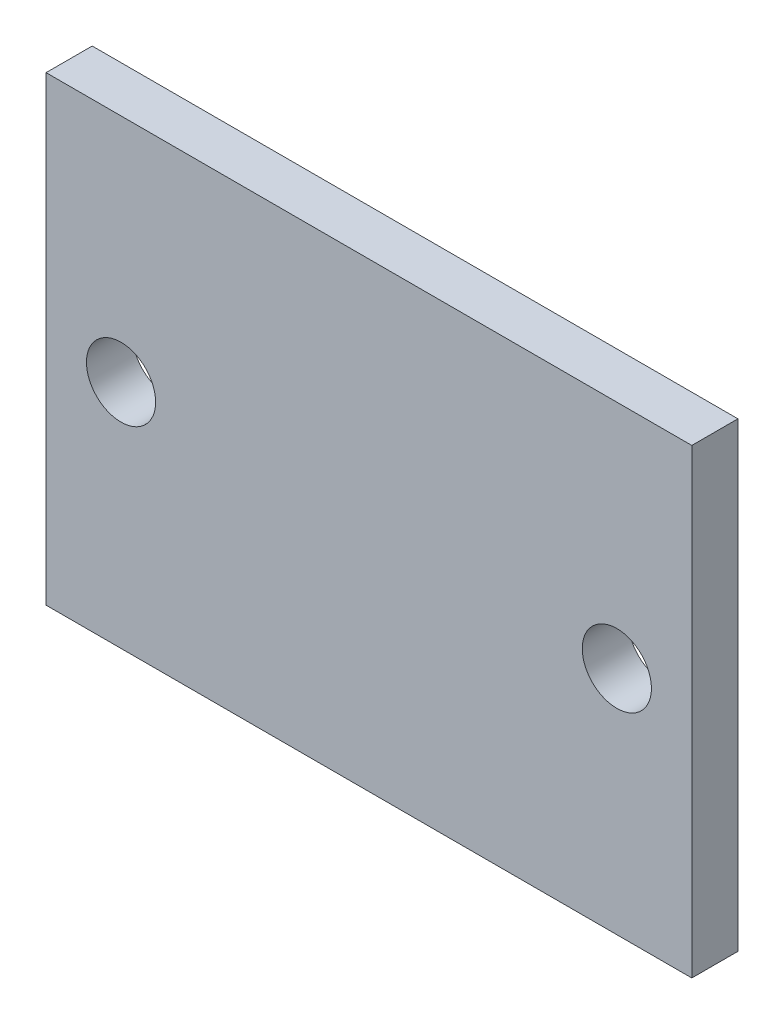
ISO-10303-21;
HEADER;
FILE_DESCRIPTION(('STEP AP214'),'2;1');
FILE_NAME('part.step','',(''),(''),'','','');
FILE_SCHEMA(('AUTOMOTIVE_DESIGN { 1 0 10303 214 1 1 1 1 }'));
ENDSEC;
DATA;
#1=APPLICATION_CONTEXT('core data for automotive mechanical design processes');
#2=APPLICATION_PROTOCOL_DEFINITION('international standard','automotive_design',2000,#1);
#3=PRODUCT_CONTEXT('',#1,'mechanical');
#4=PRODUCT('Part','Part','',(#3));
#5=PRODUCT_RELATED_PRODUCT_CATEGORY('part','',(#4));
#6=PRODUCT_DEFINITION_FORMATION('','',#4);
#7=PRODUCT_DEFINITION_CONTEXT('part definition',#1,'design');
#8=PRODUCT_DEFINITION('design','',#6,#7);
#9=PRODUCT_DEFINITION_SHAPE('','',#8);
#10=(LENGTH_UNIT() NAMED_UNIT(*) SI_UNIT(.MILLI.,.METRE.));
#11=(NAMED_UNIT(*) PLANE_ANGLE_UNIT() SI_UNIT($,.RADIAN.));
#12=(NAMED_UNIT(*) SI_UNIT($,.STERADIAN.) SOLID_ANGLE_UNIT());
#13=UNCERTAINTY_MEASURE_WITH_UNIT(LENGTH_MEASURE(1.E-05),#10,'distance_accuracy_value','');
#14=(GEOMETRIC_REPRESENTATION_CONTEXT(3) GLOBAL_UNCERTAINTY_ASSIGNED_CONTEXT((#13)) GLOBAL_UNIT_ASSIGNED_CONTEXT((#10,
#11,#12)) REPRESENTATION_CONTEXT('',''));
#15=CARTESIAN_POINT('',(0.,0.,0.));
#16=DIRECTION('',(0.,0.,1.));
#17=DIRECTION('',(1.,0.,0.));
#18=AXIS2_PLACEMENT_3D('',#15,#16,#17);
#19=CARTESIAN_POINT('',(-14.,-10.,2.));
#20=DIRECTION('',(1.,0.,0.));
#21=DIRECTION('',(0.,0.,-1.));
#22=AXIS2_PLACEMENT_3D('',#19,#20,#21);
#23=PLANE('',#22);
#24=DIRECTION('',(0.,-1.,0.));
#25=VECTOR('',#24,1.);
#26=CARTESIAN_POINT('',(-14.,-10.,0.));
#27=LINE('',#26,#25);
#28=CARTESIAN_POINT('',(-14.,10.,0.));
#29=VERTEX_POINT('',#28);
#30=CARTESIAN_POINT('',(-14.,-10.,0.));
#31=VERTEX_POINT('',#30);
#32=EDGE_CURVE('E99',#29,#31,#27,.T.);
#33=ORIENTED_EDGE('',*,*,#32,.T.);
#34=DIRECTION('',(0.,0.,-1.));
#35=VECTOR('',#34,1.);
#36=CARTESIAN_POINT('',(-14.,-10.,2.));
#37=LINE('',#36,#35);
#38=CARTESIAN_POINT('',(-14.,-10.,2.));
#39=VERTEX_POINT('',#38);
#40=EDGE_CURVE('E11',#39,#31,#37,.T.);
#41=ORIENTED_EDGE('',*,*,#40,.F.);
#42=DIRECTION('',(0.,-1.,0.));
#43=VECTOR('',#42,1.);
#44=CARTESIAN_POINT('',(-14.,-10.,2.));
#45=LINE('',#44,#43);
#46=CARTESIAN_POINT('',(-14.,10.,2.));
#47=VERTEX_POINT('',#46);
#48=EDGE_CURVE('E87',#47,#39,#45,.T.);
#49=ORIENTED_EDGE('',*,*,#48,.F.);
#50=DIRECTION('',(0.,0.,-1.));
#51=VECTOR('',#50,1.);
#52=CARTESIAN_POINT('',(-14.,10.,2.));
#53=LINE('',#52,#51);
#54=EDGE_CURVE('E95',#47,#29,#53,.T.);
#55=ORIENTED_EDGE('',*,*,#54,.T.);
#56=EDGE_LOOP('',(#33,#41,#49,#55));
#57=FACE_BOUND('',#56,.T.);
#58=ADVANCED_FACE('F36',(#57),#23,.F.);
#59=CARTESIAN_POINT('',(14.,-10.,2.));
#60=DIRECTION('',(0.,1.,0.));
#61=DIRECTION('',(-1.,0.,0.));
#62=AXIS2_PLACEMENT_3D('',#59,#60,#61);
#63=PLANE('',#62);
#64=DIRECTION('',(1.,0.,0.));
#65=VECTOR('',#64,1.);
#66=CARTESIAN_POINT('',(14.,-10.,0.));
#67=LINE('',#66,#65);
#68=CARTESIAN_POINT('',(14.,-10.,0.));
#69=VERTEX_POINT('',#68);
#70=EDGE_CURVE('E91',#31,#69,#67,.T.);
#71=ORIENTED_EDGE('',*,*,#70,.T.);
#72=DIRECTION('',(0.,0.,-1.));
#73=VECTOR('',#72,1.);
#74=CARTESIAN_POINT('',(14.,-10.,2.));
#75=LINE('',#74,#73);
#76=CARTESIAN_POINT('',(14.,-10.,2.));
#77=VERTEX_POINT('',#76);
#78=EDGE_CURVE('E44',#77,#69,#75,.T.);
#79=ORIENTED_EDGE('',*,*,#78,.F.);
#80=DIRECTION('',(1.,0.,0.));
#81=VECTOR('',#80,1.);
#82=CARTESIAN_POINT('',(14.,-10.,2.));
#83=LINE('',#82,#81);
#84=EDGE_CURVE('E82',#39,#77,#83,.T.);
#85=ORIENTED_EDGE('',*,*,#84,.F.);
#86=ORIENTED_EDGE('',*,*,#40,.T.);
#87=EDGE_LOOP('',(#71,#79,#85,#86));
#88=FACE_BOUND('',#87,.T.);
#89=ADVANCED_FACE('F90',(#88),#63,.F.);
#90=CARTESIAN_POINT('',(14.,-10.,2.));
#91=DIRECTION('',(-1.,0.,0.));
#92=DIRECTION('',(0.,-1.,0.));
#93=AXIS2_PLACEMENT_3D('',#90,#91,#92);
#94=PLANE('',#93);
#95=DIRECTION('',(0.,1.,0.));
#96=VECTOR('',#95,1.);
#97=CARTESIAN_POINT('',(14.,-10.,0.));
#98=LINE('',#97,#96);
#99=CARTESIAN_POINT('',(14.,10.,0.));
#100=VERTEX_POINT('',#99);
#101=EDGE_CURVE('E69',#69,#100,#98,.T.);
#102=ORIENTED_EDGE('',*,*,#101,.T.);
#103=DIRECTION('',(0.,0.,-1.));
#104=VECTOR('',#103,1.);
#105=CARTESIAN_POINT('',(14.,10.,2.));
#106=LINE('',#105,#104);
#107=CARTESIAN_POINT('',(14.,10.,2.));
#108=VERTEX_POINT('',#107);
#109=EDGE_CURVE('E92',#108,#100,#106,.T.);
#110=ORIENTED_EDGE('',*,*,#109,.F.);
#111=DIRECTION('',(0.,1.,0.));
#112=VECTOR('',#111,1.);
#113=CARTESIAN_POINT('',(14.,-10.,2.));
#114=LINE('',#113,#112);
#115=EDGE_CURVE('E85',#77,#108,#114,.T.);
#116=ORIENTED_EDGE('',*,*,#115,.F.);
#117=ORIENTED_EDGE('',*,*,#78,.T.);
#118=EDGE_LOOP('',(#102,#110,#116,#117));
#119=FACE_BOUND('',#118,.T.);
#120=ADVANCED_FACE('F93',(#119),#94,.F.);
#121=CARTESIAN_POINT('',(14.,10.,2.));
#122=DIRECTION('',(0.,-1.,0.));
#123=DIRECTION('',(1.,0.,0.));
#124=AXIS2_PLACEMENT_3D('',#121,#122,#123);
#125=PLANE('',#124);
#126=DIRECTION('',(-1.,0.,0.));
#127=VECTOR('',#126,1.);
#128=CARTESIAN_POINT('',(14.,10.,0.));
#129=LINE('',#128,#127);
#130=EDGE_CURVE('E75',#100,#29,#129,.T.);
#131=ORIENTED_EDGE('',*,*,#130,.T.);
#132=ORIENTED_EDGE('',*,*,#54,.F.);
#133=DIRECTION('',(-1.,0.,0.));
#134=VECTOR('',#133,1.);
#135=CARTESIAN_POINT('',(14.,10.,2.));
#136=LINE('',#135,#134);
#137=EDGE_CURVE('E52',#108,#47,#136,.T.);
#138=ORIENTED_EDGE('',*,*,#137,.F.);
#139=ORIENTED_EDGE('',*,*,#109,.T.);
#140=EDGE_LOOP('',(#131,#132,#138,#139));
#141=FACE_BOUND('',#140,.T.);
#142=ADVANCED_FACE('F107',(#141),#125,.F.);
#143=CARTESIAN_POINT('',(0.,0.,2.));
#144=DIRECTION('',(0.,0.,1.));
#145=DIRECTION('',(1.,0.,0.));
#146=AXIS2_PLACEMENT_3D('',#143,#144,#145);
#147=PLANE('',#146);
#148=CARTESIAN_POINT('',(-10.75,0.,2.));
#149=DIRECTION('',(0.,0.,1.));
#150=DIRECTION('',(1.,0.,0.));
#151=AXIS2_PLACEMENT_3D('',#148,#149,#150);
#152=CIRCLE('',#151,1.5);
#153=CARTESIAN_POINT('',(-9.25,0.,2.));
#154=VERTEX_POINT('',#153);
#155=EDGE_CURVE('E116',#154,#154,#152,.T.);
#156=ORIENTED_EDGE('',*,*,#155,.F.);
#157=EDGE_LOOP('',(#156));
#158=FACE_BOUND('',#157,.T.);
#159=CARTESIAN_POINT('',(10.75,0.,2.));
#160=DIRECTION('',(0.,0.,1.));
#161=DIRECTION('',(1.,0.,0.));
#162=AXIS2_PLACEMENT_3D('',#159,#160,#161);
#163=CIRCLE('',#162,1.5);
#164=CARTESIAN_POINT('',(12.25,0.,2.));
#165=VERTEX_POINT('',#164);
#166=EDGE_CURVE('E117',#165,#165,#163,.T.);
#167=ORIENTED_EDGE('',*,*,#166,.F.);
#168=EDGE_LOOP('',(#167));
#169=FACE_BOUND('',#168,.T.);
#170=ORIENTED_EDGE('',*,*,#48,.T.);
#171=ORIENTED_EDGE('',*,*,#84,.T.);
#172=ORIENTED_EDGE('',*,*,#115,.T.);
#173=ORIENTED_EDGE('',*,*,#137,.T.);
#174=EDGE_LOOP('',(#170,#171,#172,#173));
#175=FACE_BOUND('',#174,.T.);
#176=ADVANCED_FACE('F83',(#158,#169,#175),#147,.T.);
#177=CARTESIAN_POINT('',(0.,0.,0.));
#178=DIRECTION('',(0.,0.,1.));
#179=DIRECTION('',(1.,0.,0.));
#180=AXIS2_PLACEMENT_3D('',#177,#178,#179);
#181=PLANE('',#180);
#182=CARTESIAN_POINT('',(-10.75,0.,0.));
#183=DIRECTION('',(0.,0.,1.));
#184=DIRECTION('',(1.,0.,0.));
#185=AXIS2_PLACEMENT_3D('',#182,#183,#184);
#186=CIRCLE('',#185,1.5);
#187=CARTESIAN_POINT('',(-9.25,0.,0.));
#188=VERTEX_POINT('',#187);
#189=EDGE_CURVE('E102',#188,#188,#186,.F.);
#190=ORIENTED_EDGE('',*,*,#189,.F.);
#191=EDGE_LOOP('',(#190));
#192=FACE_BOUND('',#191,.T.);
#193=CARTESIAN_POINT('',(10.75,0.,0.));
#194=DIRECTION('',(0.,0.,1.));
#195=DIRECTION('',(1.,0.,0.));
#196=AXIS2_PLACEMENT_3D('',#193,#194,#195);
#197=CIRCLE('',#196,1.5);
#198=CARTESIAN_POINT('',(12.25,0.,0.));
#199=VERTEX_POINT('',#198);
#200=EDGE_CURVE('E113',#199,#199,#197,.F.);
#201=ORIENTED_EDGE('',*,*,#200,.F.);
#202=EDGE_LOOP('',(#201));
#203=FACE_BOUND('',#202,.T.);
#204=ORIENTED_EDGE('',*,*,#32,.F.);
#205=ORIENTED_EDGE('',*,*,#130,.F.);
#206=ORIENTED_EDGE('',*,*,#101,.F.);
#207=ORIENTED_EDGE('',*,*,#70,.F.);
#208=EDGE_LOOP('',(#204,#205,#206,#207));
#209=FACE_BOUND('',#208,.T.);
#210=ADVANCED_FACE('F110',(#192,#203,#209),#181,.F.);
#211=CARTESIAN_POINT('',(10.75,0.,-0.00100000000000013));
#212=DIRECTION('',(0.,0.,1.));
#213=DIRECTION('',(1.,0.,0.));
#214=AXIS2_PLACEMENT_3D('',#211,#212,#213);
#215=CYLINDRICAL_SURFACE('',#214,1.5);
#216=ORIENTED_EDGE('',*,*,#166,.T.);
#217=EDGE_LOOP('',(#216));
#218=FACE_BOUND('',#217,.T.);
#219=ORIENTED_EDGE('',*,*,#200,.T.);
#220=EDGE_LOOP('',(#219));
#221=FACE_BOUND('',#220,.T.);
#222=ADVANCED_FACE('F133',(#218,#221),#215,.F.);
#223=CARTESIAN_POINT('',(-10.75,0.,-0.00100000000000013));
#224=DIRECTION('',(0.,0.,1.));
#225=DIRECTION('',(1.,0.,0.));
#226=AXIS2_PLACEMENT_3D('',#223,#224,#225);
#227=CYLINDRICAL_SURFACE('',#226,1.5);
#228=ORIENTED_EDGE('',*,*,#155,.T.);
#229=EDGE_LOOP('',(#228));
#230=FACE_BOUND('',#229,.T.);
#231=ORIENTED_EDGE('',*,*,#189,.T.);
#232=EDGE_LOOP('',(#231));
#233=FACE_BOUND('',#232,.T.);
#234=ADVANCED_FACE('F125',(#230,#233),#227,.F.);
#235=CLOSED_SHELL('',(#58,#89,#120,#142,#176,#210,#222,#234));
#236=MANIFOLD_SOLID_BREP('B2',#235);
#237=ADVANCED_BREP_SHAPE_REPRESENTATION('',(#18,#236),#14);
#238=SHAPE_DEFINITION_REPRESENTATION(#9,#237);
ENDSEC;
END-ISO-10303-21;
